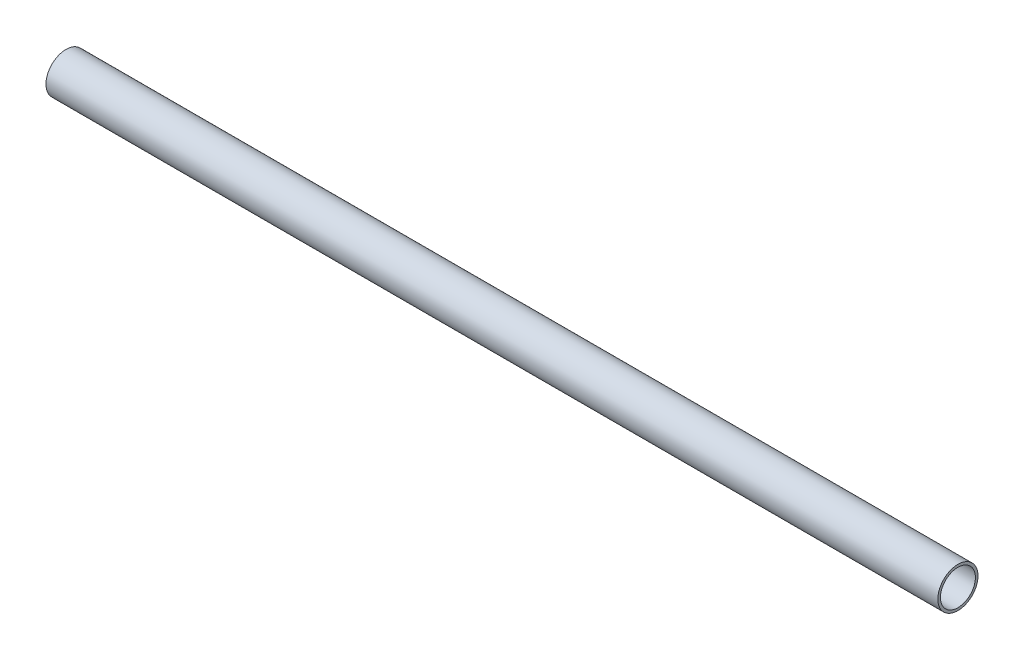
ISO-10303-21;
HEADER;
FILE_DESCRIPTION(('STEP AP214'),'2;1');
FILE_NAME('part.step','',(''),(''),'','','');
FILE_SCHEMA(('AUTOMOTIVE_DESIGN { 1 0 10303 214 1 1 1 1 }'));
ENDSEC;
DATA;
#1=APPLICATION_CONTEXT('core data for automotive mechanical design processes');
#2=APPLICATION_PROTOCOL_DEFINITION('international standard','automotive_design',2000,#1);
#3=PRODUCT_CONTEXT('',#1,'mechanical');
#4=PRODUCT('Part','Part','',(#3));
#5=PRODUCT_RELATED_PRODUCT_CATEGORY('part','',(#4));
#6=PRODUCT_DEFINITION_FORMATION('','',#4);
#7=PRODUCT_DEFINITION_CONTEXT('part definition',#1,'design');
#8=PRODUCT_DEFINITION('design','',#6,#7);
#9=PRODUCT_DEFINITION_SHAPE('','',#8);
#10=(LENGTH_UNIT() NAMED_UNIT(*) SI_UNIT(.MILLI.,.METRE.));
#11=(NAMED_UNIT(*) PLANE_ANGLE_UNIT() SI_UNIT($,.RADIAN.));
#12=(NAMED_UNIT(*) SI_UNIT($,.STERADIAN.) SOLID_ANGLE_UNIT());
#13=UNCERTAINTY_MEASURE_WITH_UNIT(LENGTH_MEASURE(1.E-05),#10,'distance_accuracy_value','');
#14=(GEOMETRIC_REPRESENTATION_CONTEXT(3) GLOBAL_UNCERTAINTY_ASSIGNED_CONTEXT((#13)) GLOBAL_UNIT_ASSIGNED_CONTEXT((#10,
#11,#12)) REPRESENTATION_CONTEXT('',''));
#15=CARTESIAN_POINT('',(0.,0.,0.));
#16=DIRECTION('',(0.,0.,1.));
#17=DIRECTION('',(1.,0.,0.));
#18=AXIS2_PLACEMENT_3D('',#15,#16,#17);
#19=CARTESIAN_POINT('',(161.925,6.34999999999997,0.));
#20=DIRECTION('',(1.,0.,0.));
#21=DIRECTION('',(0.,0.,-1.));
#22=AXIS2_PLACEMENT_3D('',#19,#20,#21);
#23=PLANE('',#22);
#24=CARTESIAN_POINT('',(161.925,0.,0.));
#25=DIRECTION('',(1.,0.,0.));
#26=DIRECTION('',(0.,0.,-1.));
#27=AXIS2_PLACEMENT_3D('',#24,#25,#26);
#28=CIRCLE('',#27,7.28979999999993);
#29=CARTESIAN_POINT('',(161.925,0.,-7.28979999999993));
#30=VERTEX_POINT('',#29);
#31=EDGE_CURVE('E10',#30,#30,#28,.T.);
#32=ORIENTED_EDGE('',*,*,#31,.T.);
#33=EDGE_LOOP('',(#32));
#34=FACE_BOUND('',#33,.T.);
#35=CARTESIAN_POINT('',(161.925,0.,0.));
#36=DIRECTION('',(1.,0.,0.));
#37=DIRECTION('',(0.,0.,-1.));
#38=AXIS2_PLACEMENT_3D('',#35,#36,#37);
#39=CIRCLE('',#38,6.34999999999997);
#40=CARTESIAN_POINT('',(161.925,0.,-6.34999999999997));
#41=VERTEX_POINT('',#40);
#42=EDGE_CURVE('E46',#41,#41,#39,.T.);
#43=ORIENTED_EDGE('',*,*,#42,.F.);
#44=EDGE_LOOP('',(#43));
#45=FACE_BOUND('',#44,.T.);
#46=ADVANCED_FACE('F32',(#34,#45),#23,.T.);
#47=CARTESIAN_POINT('',(88.8575336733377,0.,0.));
#48=DIRECTION('',(1.,0.,0.));
#49=DIRECTION('',(0.,0.,-1.));
#50=AXIS2_PLACEMENT_3D('',#47,#48,#49);
#51=CYLINDRICAL_SURFACE('',#50,7.28979999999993);
#52=CARTESIAN_POINT('',(-161.925,0.,0.));
#53=DIRECTION('',(1.,0.,0.));
#54=DIRECTION('',(0.,0.,-1.));
#55=AXIS2_PLACEMENT_3D('',#52,#53,#54);
#56=CIRCLE('',#55,7.28979999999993);
#57=CARTESIAN_POINT('',(-161.925,0.,-7.28979999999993));
#58=VERTEX_POINT('',#57);
#59=EDGE_CURVE('E38',#58,#58,#56,.T.);
#60=ORIENTED_EDGE('',*,*,#59,.T.);
#61=EDGE_LOOP('',(#60));
#62=FACE_BOUND('',#61,.T.);
#63=ORIENTED_EDGE('',*,*,#31,.F.);
#64=EDGE_LOOP('',(#63));
#65=FACE_BOUND('',#64,.T.);
#66=ADVANCED_FACE('F56',(#62,#65),#51,.T.);
#67=CARTESIAN_POINT('',(-161.925,7.28979999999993,0.));
#68=DIRECTION('',(-1.,0.,0.));
#69=DIRECTION('',(0.,0.,1.));
#70=AXIS2_PLACEMENT_3D('',#67,#68,#69);
#71=PLANE('',#70);
#72=CARTESIAN_POINT('',(-161.925,0.,0.));
#73=DIRECTION('',(1.,0.,0.));
#74=DIRECTION('',(0.,0.,-1.));
#75=AXIS2_PLACEMENT_3D('',#72,#73,#74);
#76=CIRCLE('',#75,6.34999999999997);
#77=CARTESIAN_POINT('',(-161.925,0.,-6.34999999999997));
#78=VERTEX_POINT('',#77);
#79=EDGE_CURVE('E42',#78,#78,#76,.T.);
#80=ORIENTED_EDGE('',*,*,#79,.T.);
#81=EDGE_LOOP('',(#80));
#82=FACE_BOUND('',#81,.T.);
#83=ORIENTED_EDGE('',*,*,#59,.F.);
#84=EDGE_LOOP('',(#83));
#85=FACE_BOUND('',#84,.T.);
#86=ADVANCED_FACE('F60',(#82,#85),#71,.T.);
#87=CARTESIAN_POINT('',(88.8575336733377,0.,0.));
#88=DIRECTION('',(1.,0.,0.));
#89=DIRECTION('',(0.,0.,-1.));
#90=AXIS2_PLACEMENT_3D('',#87,#88,#89);
#91=CYLINDRICAL_SURFACE('',#90,6.34999999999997);
#92=ORIENTED_EDGE('',*,*,#42,.T.);
#93=EDGE_LOOP('',(#92));
#94=FACE_BOUND('',#93,.T.);
#95=ORIENTED_EDGE('',*,*,#79,.F.);
#96=EDGE_LOOP('',(#95));
#97=FACE_BOUND('',#96,.T.);
#98=ADVANCED_FACE('F52',(#94,#97),#91,.F.);
#99=CLOSED_SHELL('',(#46,#66,#86,#98));
#100=MANIFOLD_SOLID_BREP('B2',#99);
#101=ADVANCED_BREP_SHAPE_REPRESENTATION('',(#18,#100),#14);
#102=SHAPE_DEFINITION_REPRESENTATION(#9,#101);
ENDSEC;
END-ISO-10303-21;
